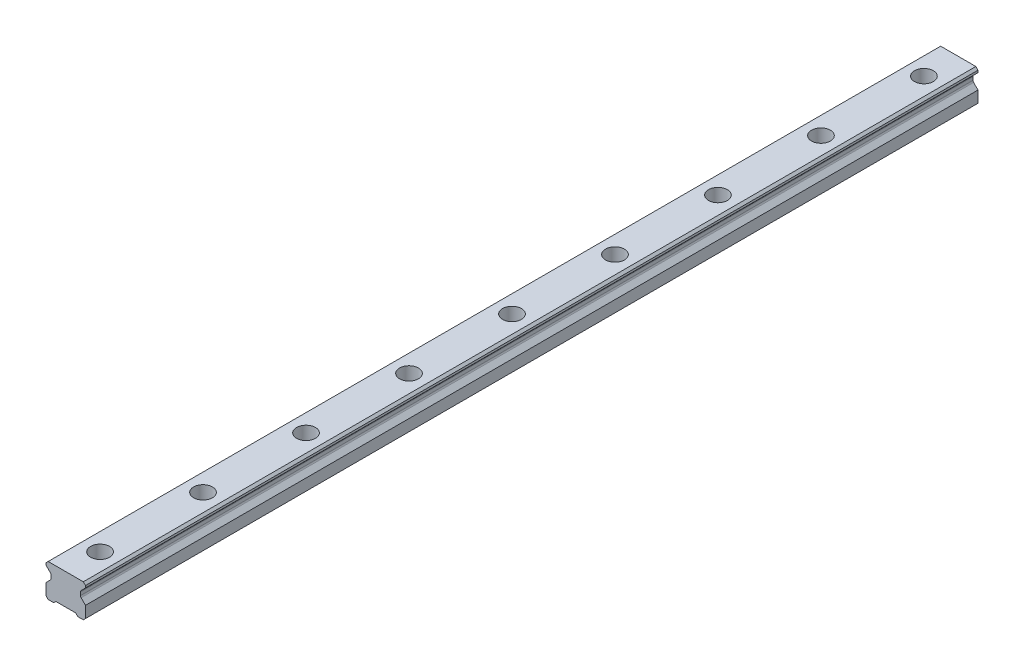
from build123d import *

# Parameters (mm, degrees)
SKETCH1_W           = 23
SKETCH1_H           = 19.2
BOSS_EXTRUDE1_DEPTH = 260
CUT_EXTRUDE1_DEPTH  = 521.481402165
CHAMFER1_SIZE       = 1.25
FILLET1_R           = 1.25
CUT_EXTRUDE2_DEPTH  = 521.481402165
SKETCH4_R           = 5.5
SKETCH4_R_2         = 3.5
CUT_EXTRUDE3_DEPTH  = 9
SKETCH4_2_R         = 3.5
CUT_EXTRUDE4_DEPTH  = 261.961472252
LPATTERN1_COUNT     = 9
LPATTERN1_PITCH     = 60


with BuildPart() as part:
    # Sketch1 → Boss-Extrude1 (new, symmetric)
    with BuildSketch(Plane.XY):
        with Locations((0, 9.6)):
            Rectangle(SKETCH1_W, SKETCH1_H)
    extrude(amount=BOSS_EXTRUDE1_DEPTH, both=True)

    # Sketch2 → Cut-Extrude1 (cut, through all)
    with BuildSketch(Plane.XY.offset(260)):
        Polygon((-11.5, 16.7), (-11.5, 7.95), (-8.583333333, 10.866666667), (-8.583333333, 13.783333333), align=None)
        Polygon((8.583333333, 13.783333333), (11.5, 16.7), (11.5, 7.95), (8.583333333, 10.866666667), align=None)
    extrude(amount=-CUT_EXTRUDE1_DEPTH, mode=Mode.SUBTRACT)

    # Chamfer1
    chamfer1_edges = [part.edges().sort_by_distance(p)[0] for p in [
        (-11.5, 19.2, 0),
        (11.5, 19.2, 0),
        (11.5, 0, 0),
        (-11.5, 0, 0),
    ]]
    chamfer(chamfer1_edges, length=CHAMFER1_SIZE)

    # Fillet1
    fillet1_edges = [part.edges().sort_by_distance(p)[0] for p in [
        (-8.583333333, 13.783333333, 0),
        (-8.583333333, 10.866666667, 0),
        (8.583333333, 10.866666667, 0),
        (8.583333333, 13.783333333, 0),
    ]]
    fillet(fillet1_edges, radius=FILLET1_R)

    # Sketch3 → Cut-Extrude2 (cut, through all)
    with BuildSketch(Plane.XY.offset(260)):
        Polygon((-7, 0), (-5.75, 1.25), (5.75, 1.25), (7, 0), align=None)
    extrude(amount=-CUT_EXTRUDE2_DEPTH, mode=Mode.SUBTRACT)

    # Sketch4 → Cut-Extrude3 (cut)
    with BuildSketch(Plane(origin=(0, 19.2, 0), x_dir=(1, 0, 0), z_dir=(0, 1, 0))):
        with Locations(Location((0, -240, 0), (0, 0, 270))):
            Circle(SKETCH4_R)
        with Locations(Location((0, -240, 0), (0, 0, 270))):
            Circle(SKETCH4_R_2, mode=Mode.SUBTRACT)
    cut_extrude3 = extrude(amount=-CUT_EXTRUDE3_DEPTH, mode=Mode.SUBTRACT)

    # Sketch4_2 → Cut-Extrude4 (cut, through all)
    with BuildSketch(Plane(origin=(0, 19.2, 0), x_dir=(1, 0, 0), z_dir=(0, 1, 0))):
        with Locations(Location((0, -240, 0), (0, 0, 270))):
            Circle(SKETCH4_2_R)
    cut_extrude4 = extrude(amount=-CUT_EXTRUDE4_DEPTH, mode=Mode.SUBTRACT)

    # LPattern1: Cut-Extrude3, Cut-Extrude4 ×9
    with Locations(*[(0, 0, -i * LPATTERN1_PITCH) for i in range(1, LPATTERN1_COUNT)]):
        add(cut_extrude3, mode=Mode.SUBTRACT)
        add(cut_extrude4, mode=Mode.SUBTRACT)


solid = part.part
